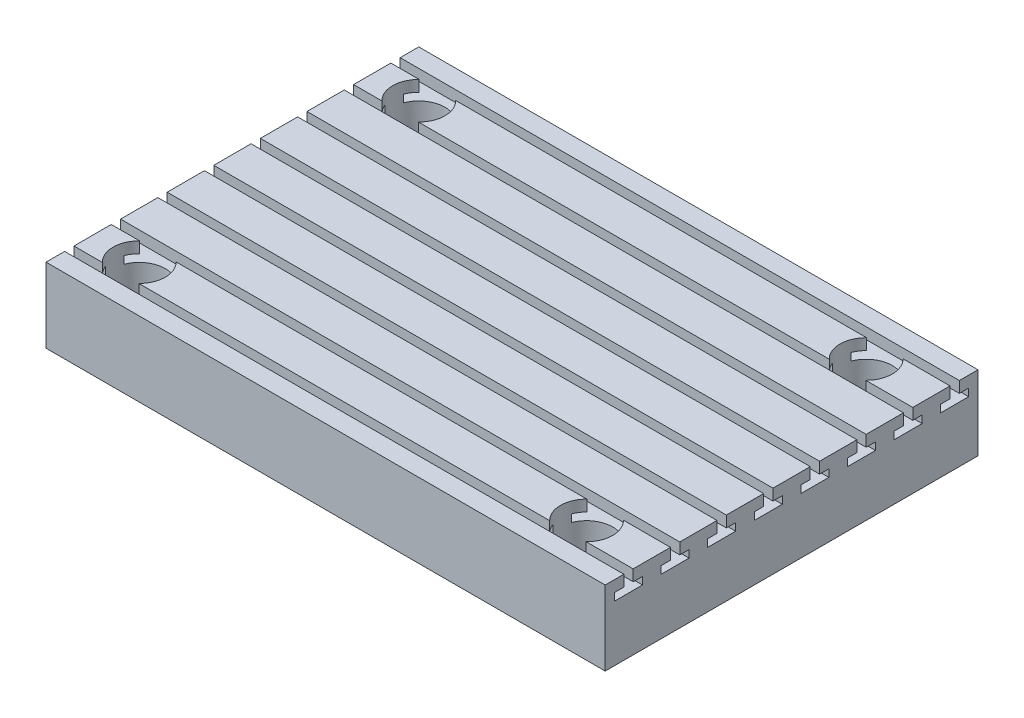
from build123d import *

# Parameters (mm, degrees)
SKETCH1_W                      = 150
SKETCH1_H                      = 100
EXTRUDE1_DEPTH                 = 20
F_9_16_0_5625_DIAMETER_HOLE1_D = 13.99999994
LPATTERN1_COUNT                = 2
LPATTERN1_PITCH                = 120
LPATTERN1_COUNT_DIR2           = 2
LPATTERN1_PITCH_DIR2           = 75
CUT_EXTRUDE2_DEPTH             = 160.373774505
LPATTERN2_COUNT                = 8
LPATTERN2_PITCH                = 12.5


with BuildPart() as part:
    # Sketch1 → Extrude1 (new body)
    with BuildSketch(Plane(origin=(0, 0, 0), x_dir=(1, 0, 0), z_dir=(0, 1, 0))):
        Rectangle(SKETCH1_W, SKETCH1_H)
    extrude(amount=EXTRUDE1_DEPTH)

    # 9_16 _0.5625_ Diameter Hole1 (through all)
    with Locations(Plane(origin=(0, 20, 0), x_dir=(-1, 0, 0), z_dir=(0, 1, 0))):
        with Locations((62.5, 37.5)):
            f_9_16_0_5625_diameter_hole1 = Hole(F_9_16_0_5625_DIAMETER_HOLE1_D / 2)

    # LPattern1: 9_16 _0.5625_ Diameter Hole1 2 × 2
    with Locations(*[(i * LPATTERN1_PITCH, 0, -j * LPATTERN1_PITCH_DIR2) for i in range(LPATTERN1_COUNT) for j in range(LPATTERN1_COUNT_DIR2) if (i, j) != (0, 0)]):
        add(f_9_16_0_5625_diameter_hole1, mode=Mode.SUBTRACT)

    # Sketch5 → Cut-Extrude2 (cut, through all)
    with BuildSketch(Plane(origin=(75, 0, 0), x_dir=(0, 0, -1), z_dir=(1, 0, 0))):
        Polygon((-45, 20), (-45, 17), (-47.5, 17), (-47.5, 15), (-40, 15), (-40, 17), (-42.5, 17), (-42.5, 20), align=None)
    cut_extrude2 = extrude(amount=-CUT_EXTRUDE2_DEPTH, mode=Mode.SUBTRACT)

    # LPattern2: Cut-Extrude2 ×8
    with Locations(*[(0, 0, -i * LPATTERN2_PITCH) for i in range(1, LPATTERN2_COUNT)]):
        add(cut_extrude2, mode=Mode.SUBTRACT)


solid = part.part
